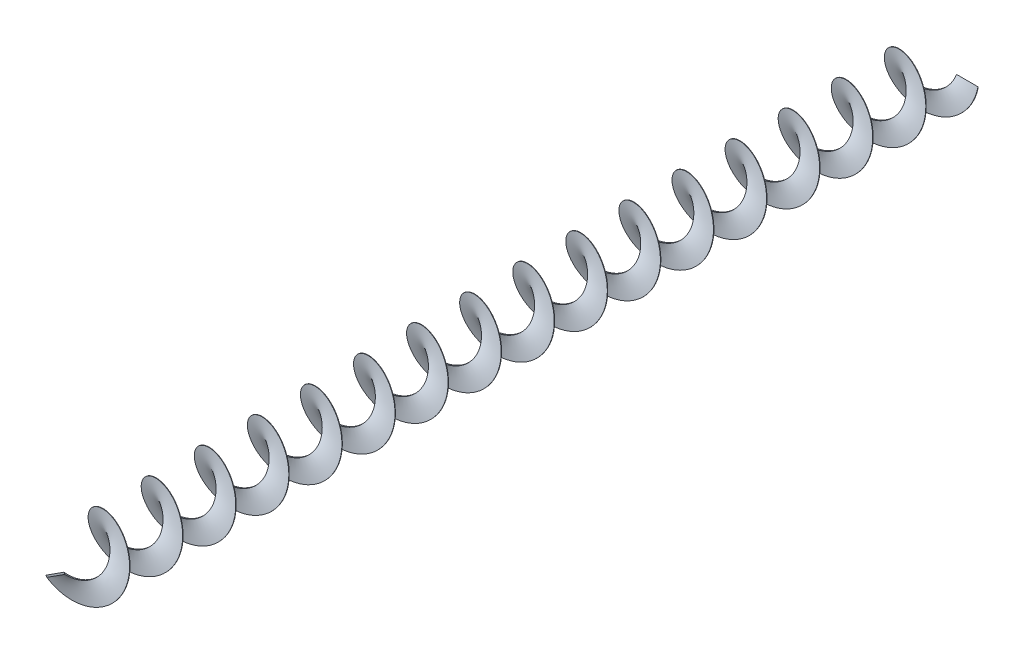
from build123d import *

# Parameters (mm, degrees)
SWEEP1_PITCH  = 250
SWEEP1_HEIGHT = 4102.16
SWEEP1_RADIUS = 154.5
SKETCH2_W     = 101
SKETCH2_H     = 8


with BuildPart() as part:
    # Sweep1: sweep along a helix
    with BuildLine() as sweep1_path:
        Helix(SWEEP1_PITCH, SWEEP1_HEIGHT, SWEEP1_RADIUS, center=(0, 0, 0), direction=(0, 0, 1), lefthand=True)
    # Sketch2 → Sweep1 (sweep)
    with BuildSketch(Plane.XY):
        with Locations((104.5, 0)):
            Rectangle(SKETCH2_W, SKETCH2_H)
    sweep(path=sweep1_path.line, is_frenet=True)


solid = part.part
